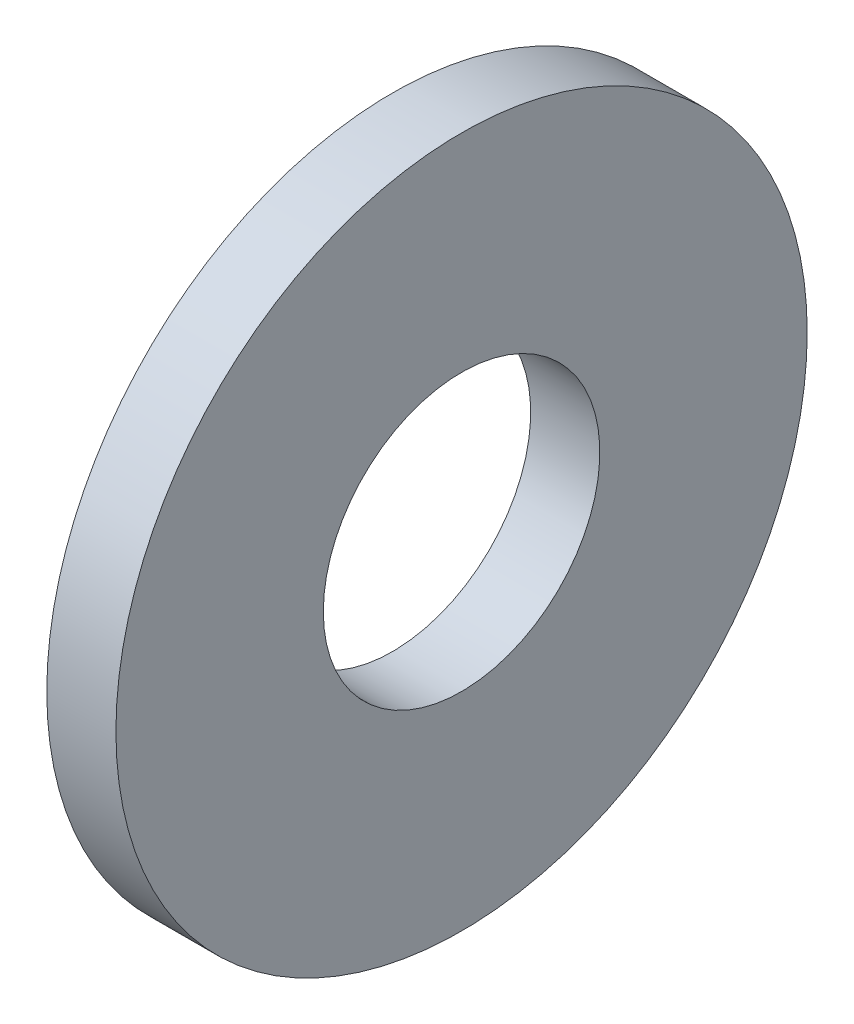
from build123d import *

# Parameters (mm, degrees)
ESQUISSE1_W = 0.8
ESQUISSE1_H = 2.4


with BuildPart() as part:
    # Esquisse1 → Base-R_volution (revolve)
    with BuildSketch(Plane(origin=(0, 0, 0), x_dir=(1, 0, 0), z_dir=(0, 1, 0)), mode=Mode.PRIVATE) as base_r_volution_sk:
        with Locations((0.4, 2.8)):
            Rectangle(ESQUISSE1_W, ESQUISSE1_H)
    revolve(base_r_volution_sk.sketch.rotate(Axis((0, 0, 0), (1, 0, 0)), 180), axis=Axis((0, 0, 0), (1, 0, 0)))


solid = part.part
